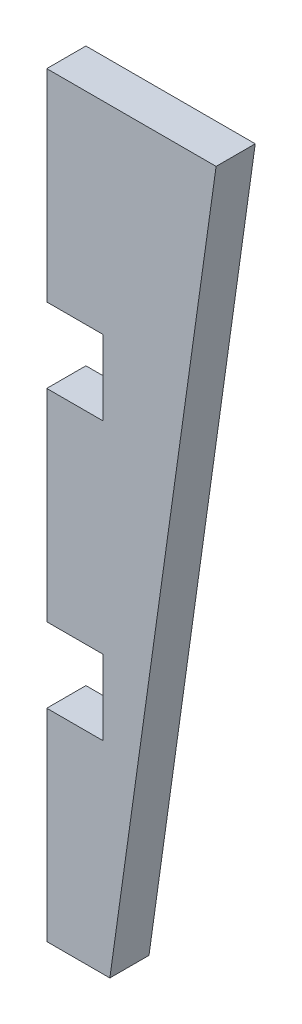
from build123d import *

# Parameters (mm, degrees)
EXTRUDE1_DEPTH                 = 2.615
F_4_40_TAPPED_HOLE1_AT_2_COUNT = 2
F_4_40_TAPPED_HOLE1_AT_2_PITCH = 37
F_4_40_TAPPED_HOLE1_AT_3_COUNT = 2
F_4_40_TAPPED_HOLE1_AT_3_PITCH = 74
F_4_40_TAPPED_HOLE1_AT_4_COUNT = 2
F_4_40_TAPPED_HOLE1_AT_4_PITCH = 111
F_4_40_TAPPED_HOLE1_AT_5_COUNT = 2
F_4_40_TAPPED_HOLE1_AT_5_PITCH = 148
SKETCH38_W                     = 7.5
SKETCH38_H                     = 10
CUT_EXTRUDE3_DEPTH             = 214.530683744


with BuildPart() as part:
    # Sketch1 → Extrude1 (new, symmetric)
    with BuildSketch(Plane.XY):
        with BuildLine():
            Line((29.232493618, 208), (4.5, 208))
            Line((4.5, 208), (4.5, 37.873672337))
            ThreePointArc((4.5, 37.873672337), (38.14007153, 0), (4.5, -37.873672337))
            Line((4.5, -37.873672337), (4.5, -208))
            Line((4.5, -208), (29.232493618, -208))
            Line((29.232493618, -208), (12, -85.384436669))
            Line((12, -85.384436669), (12, -60))
            ThreePointArc((12, -60), (14.850141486, -49.710084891), (22.588235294, -42.352941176))
            ThreePointArc((22.588235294, -42.352941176), (48, 0), (22.588235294, 42.352941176))
            ThreePointArc((22.588235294, 42.352941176), (14.850141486, 49.710084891), (12, 60))
            Line((12, 60), (12, 85.384436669))
            Line((12, 85.384436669), (29.232493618, 208))
        make_face()
    extrude(amount=EXTRUDE1_DEPTH, both=True)

    # Sketch32 → 4-40 Tapped Hole1 (revolve, cut)
    with BuildSketch(Plane(origin=(4.5, 198, 0), x_dir=(0, 0, 1), z_dir=(0, 1, 0))):
        Polygon((0, 0), (0, 6.854664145), (1.4224, 6), (1.4224, 0), align=None)
    f_4_40_tapped_hole1 = revolve(axis=Axis((-1.85, 198, 0), (1, 0, 0)), mode=Mode.SUBTRACT)

    # 4-40 Tapped Hole1 at 2: 4-40 Tapped Hole1 ×2
    with Locations(*[(0, -i * F_4_40_TAPPED_HOLE1_AT_2_PITCH, 0) for i in range(1, F_4_40_TAPPED_HOLE1_AT_2_COUNT)]):
        add(f_4_40_tapped_hole1, mode=Mode.SUBTRACT)

    # 4-40 Tapped Hole1 at 3: 4-40 Tapped Hole1 ×2
    with Locations(*[(0, -i * F_4_40_TAPPED_HOLE1_AT_3_PITCH, 0) for i in range(1, F_4_40_TAPPED_HOLE1_AT_3_COUNT)]):
        add(f_4_40_tapped_hole1, mode=Mode.SUBTRACT)

    # 4-40 Tapped Hole1 at 4: 4-40 Tapped Hole1 ×2
    with Locations(*[(0, -i * F_4_40_TAPPED_HOLE1_AT_4_PITCH, 0) for i in range(1, F_4_40_TAPPED_HOLE1_AT_4_COUNT)]):
        add(f_4_40_tapped_hole1, mode=Mode.SUBTRACT)

    # 4-40 Tapped Hole1 at 5: 4-40 Tapped Hole1 ×2
    with Locations(*[(0, -i * F_4_40_TAPPED_HOLE1_AT_5_PITCH, 0) for i in range(1, F_4_40_TAPPED_HOLE1_AT_5_COUNT)]):
        add(f_4_40_tapped_hole1, mode=Mode.SUBTRACT)

    # Mirror2: 4-40 Tapped Hole1 across plane
    add(f_4_40_tapped_hole1.mirror(Plane.ZX), mode=Mode.SUBTRACT)

    # Mirror2 copy 1 sketch → Mirror2 copy 1 (revolve, cut)
    with BuildSketch(Plane(origin=(4.5, -161, 0), x_dir=(0, 0, 1), z_dir=(0, -1, 0))):
        Polygon((0, 0), (0, -6.854664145), (1.4224, -6), (1.4224, 0), align=None)
    revolve(axis=Axis((-1.85, -161, 0), (-1, 0, 0)), mode=Mode.SUBTRACT)

    # Mirror2 copy 2 sketch → Mirror2 copy 2 (revolve, cut)
    with BuildSketch(Plane(origin=(4.5, -124, 0), x_dir=(0, 0, 1), z_dir=(0, -1, 0))):
        Polygon((0, 0), (0, -6.854664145), (1.4224, -6), (1.4224, 0), align=None)
    revolve(axis=Axis((-1.85, -124, 0), (-1, 0, 0)), mode=Mode.SUBTRACT)

    # Mirror2 copy 3 sketch → Mirror2 copy 3 (revolve, cut)
    with BuildSketch(Plane(origin=(4.5, -87, 0), x_dir=(0, 0, 1), z_dir=(0, -1, 0))):
        Polygon((0, 0), (0, -6.854664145), (1.4224, -6), (1.4224, 0), align=None)
    revolve(axis=Axis((-1.85, -87, 0), (-1, 0, 0)), mode=Mode.SUBTRACT)

    # Mirror2 copy 4 sketch → Mirror2 copy 4 (revolve, cut)
    with BuildSketch(Plane(origin=(4.5, -50, 0), x_dir=(0, 0, 1), z_dir=(0, -1, 0))):
        Polygon((0, 0), (0, -6.854664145), (1.4224, -6), (1.4224, 0), align=None)
    revolve(axis=Axis((-1.85, -50, 0), (-1, 0, 0)), mode=Mode.SUBTRACT)

    # Sketch34 → Cut-Revolve1 (revolve, cut)
    with BuildSketch(Plane.XY):
        Polygon((11.018460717, 210.244755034), (10.543822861, 201.188125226), (12.007253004, 201.933780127), (12.438911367, 210.17031237), align=None)
    cut_revolve1 = revolve(axis=Axis((0, 0, 0), (0.05233595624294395, 0.9986295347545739, 0)), mode=Mode.SUBTRACT)

    # Sketch35 → Cut-Revolve2 (revolve, cut)
    with BuildSketch(Plane.XY):
        Polygon((21.99124036, 209.232675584), (21.159073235, 201.315134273), (22.477662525, 201.902208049), (23.234392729, 209.102015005), align=None)
    cut_revolve2 = revolve(axis=Axis((0, 0, 0), (0.1045284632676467, 0.9945218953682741, 0)), mode=Mode.SUBTRACT)

    # Mirror3: Cut-Revolve1, Cut-Revolve2 across plane
    add(cut_revolve1.mirror(Plane.ZX), mode=Mode.SUBTRACT)
    add(cut_revolve2.mirror(Plane.ZX), mode=Mode.SUBTRACT)

    # Sketch38 → Cut-Extrude3 (cut, through all)
    with BuildSketch(Plane.XY.offset(2.615)):
        with BuildLine():
            Line((4.5, 92), (12.929756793, 92))
            Line((12.929756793, 92), (12, 85.384436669))
            Line((12, 85.384436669), (12, 60))
            ThreePointArc((12, 60), (14.850141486, 49.710084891), (22.588235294, 42.352941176))
            ThreePointArc((22.588235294, 42.352941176), (48, 0), (22.588235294, -42.352941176))
            ThreePointArc((22.588235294, -42.352941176), (14.850141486, -49.710084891), (12, -60))
            Line((12, -60), (12, -85.384436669))
            Line((12, -85.384436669), (29.232493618, -208))
            Line((29.232493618, -208), (4.5, -208))
            Line((4.5, -208), (4.5, -37.873672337))
            ThreePointArc((4.5, -37.873672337), (38.14007153, 0), (4.5, 37.873672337))
            Line((4.5, 37.873672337), (4.5, 92))
        make_face()
        Polygon((4.5, 193), (27.124381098, 193), (29.232493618, 208), (4.5, 208), align=None)
        with Locations((8.25, 161)):
            Rectangle(SKETCH38_W, SKETCH38_H)
        with Locations((8.25, 124)):
            Rectangle(SKETCH38_W, SKETCH38_H)
    extrude(amount=-CUT_EXTRUDE3_DEPTH, mode=Mode.SUBTRACT)


solid = part.part
